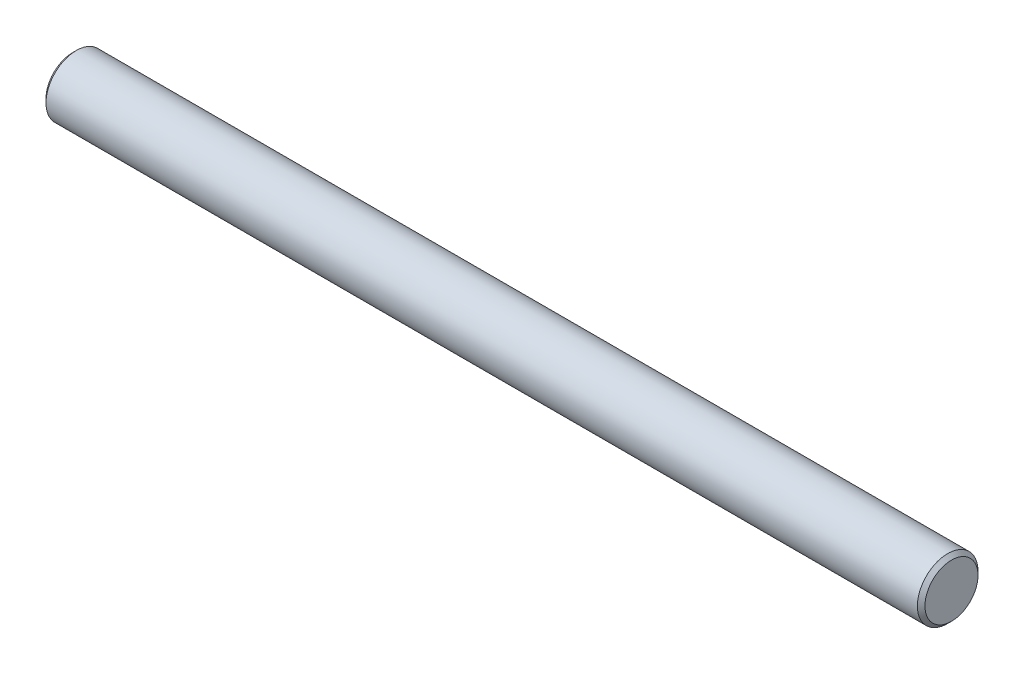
ISO-10303-21;
HEADER;
FILE_DESCRIPTION(('STEP AP214'),'2;1');
FILE_NAME('part.step','',(''),(''),'','','');
FILE_SCHEMA(('AUTOMOTIVE_DESIGN { 1 0 10303 214 1 1 1 1 }'));
ENDSEC;
DATA;
#1=APPLICATION_CONTEXT('core data for automotive mechanical design processes');
#2=APPLICATION_PROTOCOL_DEFINITION('international standard','automotive_design',2000,#1);
#3=PRODUCT_CONTEXT('',#1,'mechanical');
#4=PRODUCT('Part','Part','',(#3));
#5=PRODUCT_RELATED_PRODUCT_CATEGORY('part','',(#4));
#6=PRODUCT_DEFINITION_FORMATION('','',#4);
#7=PRODUCT_DEFINITION_CONTEXT('part definition',#1,'design');
#8=PRODUCT_DEFINITION('design','',#6,#7);
#9=PRODUCT_DEFINITION_SHAPE('','',#8);
#10=(LENGTH_UNIT() NAMED_UNIT(*) SI_UNIT(.MILLI.,.METRE.));
#11=(NAMED_UNIT(*) PLANE_ANGLE_UNIT() SI_UNIT($,.RADIAN.));
#12=(NAMED_UNIT(*) SI_UNIT($,.STERADIAN.) SOLID_ANGLE_UNIT());
#13=UNCERTAINTY_MEASURE_WITH_UNIT(LENGTH_MEASURE(1.E-05),#10,'distance_accuracy_value','');
#14=(GEOMETRIC_REPRESENTATION_CONTEXT(3) GLOBAL_UNCERTAINTY_ASSIGNED_CONTEXT((#13)) GLOBAL_UNIT_ASSIGNED_CONTEXT((#10,
#11,#12)) REPRESENTATION_CONTEXT('',''));
#15=CARTESIAN_POINT('',(0.,0.,0.));
#16=DIRECTION('',(0.,0.,1.));
#17=DIRECTION('',(1.,0.,0.));
#18=AXIS2_PLACEMENT_3D('',#15,#16,#17);
#19=CARTESIAN_POINT('',(232.,0.,0.));
#20=DIRECTION('',(-1.,0.,0.));
#21=DIRECTION('',(0.,0.,1.));
#22=AXIS2_PLACEMENT_3D('',#19,#20,#21);
#23=CYLINDRICAL_SURFACE('',#22,8.);
#24=CARTESIAN_POINT('',(231.,0.,0.));
#25=DIRECTION('',(1.,0.,0.));
#26=DIRECTION('',(0.,0.,-1.));
#27=AXIS2_PLACEMENT_3D('',#24,#25,#26);
#28=CIRCLE('',#27,8.);
#29=CARTESIAN_POINT('',(231.,0.,8.));
#30=VERTEX_POINT('',#29);
#31=EDGE_CURVE('E9178',#30,#30,#28,.F.);
#32=CARTESIAN_POINT('',(1.00000000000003,0.,0.));
#33=DIRECTION('',(1.,0.,0.));
#34=DIRECTION('',(0.,0.,-1.));
#35=AXIS2_PLACEMENT_3D('',#32,#33,#34);
#36=CIRCLE('',#35,8.);
#37=CARTESIAN_POINT('',(1.,0.,8.));
#38=VERTEX_POINT('',#37);
#39=EDGE_CURVE('E9182',#38,#38,#36,.T.);
#40=CARTESIAN_POINT('',(231.,0.,8.));
#41=CARTESIAN_POINT('',(228.604166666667,0.,8.));
#42=CARTESIAN_POINT('',(226.208333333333,0.,8.));
#43=CARTESIAN_POINT('',(221.416666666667,0.,8.));
#44=CARTESIAN_POINT('',(219.020833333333,0.,8.));
#45=CARTESIAN_POINT('',(214.229166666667,0.,8.));
#46=CARTESIAN_POINT('',(211.833333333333,0.,8.));
#47=CARTESIAN_POINT('',(207.041666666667,0.,8.));
#48=CARTESIAN_POINT('',(204.645833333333,0.,8.));
#49=CARTESIAN_POINT('',(199.854166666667,0.,8.));
#50=CARTESIAN_POINT('',(197.458333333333,0.,8.));
#51=CARTESIAN_POINT('',(192.666666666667,0.,8.));
#52=CARTESIAN_POINT('',(190.270833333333,0.,8.));
#53=CARTESIAN_POINT('',(185.479166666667,0.,8.));
#54=CARTESIAN_POINT('',(183.083333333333,0.,8.));
#55=CARTESIAN_POINT('',(178.291666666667,0.,8.));
#56=CARTESIAN_POINT('',(175.895833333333,0.,8.));
#57=CARTESIAN_POINT('',(171.104166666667,0.,8.));
#58=CARTESIAN_POINT('',(168.708333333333,0.,8.));
#59=CARTESIAN_POINT('',(163.916666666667,0.,8.));
#60=CARTESIAN_POINT('',(161.520833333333,0.,8.));
#61=CARTESIAN_POINT('',(156.729166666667,0.,8.));
#62=CARTESIAN_POINT('',(154.333333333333,0.,8.));
#63=CARTESIAN_POINT('',(149.541666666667,0.,8.));
#64=CARTESIAN_POINT('',(147.145833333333,0.,8.));
#65=CARTESIAN_POINT('',(142.354166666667,0.,8.));
#66=CARTESIAN_POINT('',(139.958333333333,0.,8.));
#67=CARTESIAN_POINT('',(135.166666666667,0.,8.));
#68=CARTESIAN_POINT('',(132.770833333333,0.,8.));
#69=CARTESIAN_POINT('',(127.979166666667,0.,8.));
#70=CARTESIAN_POINT('',(125.583333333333,0.,8.));
#71=CARTESIAN_POINT('',(120.791666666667,0.,8.));
#72=CARTESIAN_POINT('',(118.395833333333,0.,8.));
#73=CARTESIAN_POINT('',(113.604166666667,0.,8.));
#74=CARTESIAN_POINT('',(111.208333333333,0.,8.));
#75=CARTESIAN_POINT('',(106.416666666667,0.,8.));
#76=CARTESIAN_POINT('',(104.020833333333,0.,8.));
#77=CARTESIAN_POINT('',(99.2291666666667,0.,8.));
#78=CARTESIAN_POINT('',(96.8333333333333,0.,8.));
#79=CARTESIAN_POINT('',(92.0416666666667,0.,8.));
#80=CARTESIAN_POINT('',(89.6458333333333,0.,8.));
#81=CARTESIAN_POINT('',(84.8541666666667,0.,8.));
#82=CARTESIAN_POINT('',(82.4583333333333,0.,8.));
#83=CARTESIAN_POINT('',(77.6666666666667,0.,8.));
#84=CARTESIAN_POINT('',(75.2708333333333,0.,8.));
#85=CARTESIAN_POINT('',(70.4791666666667,0.,8.));
#86=CARTESIAN_POINT('',(68.0833333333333,0.,8.));
#87=CARTESIAN_POINT('',(63.2916666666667,0.,8.));
#88=CARTESIAN_POINT('',(60.8958333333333,0.,8.));
#89=CARTESIAN_POINT('',(56.1041666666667,0.,8.));
#90=CARTESIAN_POINT('',(53.7083333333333,0.,8.));
#91=CARTESIAN_POINT('',(48.9166666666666,0.,8.));
#92=CARTESIAN_POINT('',(46.5208333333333,0.,8.));
#93=CARTESIAN_POINT('',(41.7291666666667,0.,8.));
#94=CARTESIAN_POINT('',(39.3333333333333,0.,8.));
#95=CARTESIAN_POINT('',(34.5416666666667,0.,8.));
#96=CARTESIAN_POINT('',(32.1458333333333,0.,8.));
#97=CARTESIAN_POINT('',(27.3541666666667,0.,8.));
#98=CARTESIAN_POINT('',(24.9583333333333,0.,8.));
#99=CARTESIAN_POINT('',(20.1666666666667,0.,8.));
#100=CARTESIAN_POINT('',(17.7708333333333,0.,8.));
#101=CARTESIAN_POINT('',(12.9791666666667,0.,8.));
#102=CARTESIAN_POINT('',(10.5833333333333,0.,8.));
#103=CARTESIAN_POINT('',(5.79166666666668,0.,8.));
#104=CARTESIAN_POINT('',(3.39583333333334,0.,8.));
#105=CARTESIAN_POINT('',(1.,0.,8.));
#106=B_SPLINE_CURVE_WITH_KNOTS('',3,(#40,#41,#42,#43,#44,#45,#46,#47,#48,#49,#50,#51,#52,#53,
#54,#55,#56,#57,#58,#59,#60,#61,#62,#63,#64,#65,#66,#67,#68,#69,#70,#71,#72,#73,#74,#75,#76,#77,
#78,#79,#80,#81,#82,#83,#84,#85,#86,#87,#88,#89,#90,#91,#92,#93,#94,#95,#96,#97,#98,#99,#100,
#101,#102,#103,#104,#105),.UNSPECIFIED.,.F.,.F.,(4,2,2,2,2,2,2,2,2,2,2,2,2,2,2,2,2,2,2,2,2,2,2,
2,2,2,2,2,2,2,2,2,4),(0.,7.18750000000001,14.375,21.5625,28.75,35.9375,43.125,50.3125,57.5,
64.6875,71.875,79.0625,86.25,93.4375,100.625,107.8125,115.,122.1875,129.375,136.5625,143.75,
150.9375,158.125,165.3125,172.5,179.6875,186.875,194.0625,201.25,208.4375,215.625,222.8125,
230.),.UNSPECIFIED.);
#107=EDGE_CURVE('BSEAM9172',#30,#38,#106,.T.);
#108=ORIENTED_EDGE('',*,*,#31,.T.);
#109=ORIENTED_EDGE('',*,*,#39,.T.);
#110=ORIENTED_EDGE('',*,*,#107,.T.);
#111=ORIENTED_EDGE('',*,*,#107,.F.);
#112=EDGE_LOOP('',(#108,#110,#109,#111));
#113=FACE_BOUND('',#112,.T.);
#114=ADVANCED_FACE('F9172',(#113),#23,.T.);
#115=CARTESIAN_POINT('',(232.,0.,0.));
#116=DIRECTION('',(1.,0.,0.));
#117=DIRECTION('',(0.,0.,-1.));
#118=AXIS2_PLACEMENT_3D('',#115,#116,#117);
#119=PLANE('',#118);
#120=CARTESIAN_POINT('',(232.,0.,0.));
#121=DIRECTION('',(1.,0.,0.));
#122=DIRECTION('',(0.,0.,-1.));
#123=AXIS2_PLACEMENT_3D('',#120,#121,#122);
#124=CIRCLE('',#123,7.);
#125=CARTESIAN_POINT('',(232.,0.,-7.));
#126=VERTEX_POINT('',#125);
#127=EDGE_CURVE('E9186',#126,#126,#124,.T.);
#128=ORIENTED_EDGE('',*,*,#127,.T.);
#129=EDGE_LOOP('',(#128));
#130=FACE_BOUND('',#129,.T.);
#131=ADVANCED_FACE('F9192',(#130),#119,.T.);
#132=CARTESIAN_POINT('',(0.,0.,0.));
#133=DIRECTION('',(1.,0.,0.));
#134=DIRECTION('',(0.,0.,-1.));
#135=AXIS2_PLACEMENT_3D('',#132,#133,#134);
#136=PLANE('',#135);
#137=CARTESIAN_POINT('',(0.,0.,0.));
#138=DIRECTION('',(1.,0.,0.));
#139=DIRECTION('',(0.,0.,-1.));
#140=AXIS2_PLACEMENT_3D('',#137,#138,#139);
#141=CIRCLE('',#140,6.99999999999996);
#142=CARTESIAN_POINT('',(0.,0.,-6.99999999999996));
#143=VERTEX_POINT('',#142);
#144=EDGE_CURVE('E10',#143,#143,#141,.F.);
#145=ORIENTED_EDGE('',*,*,#144,.T.);
#146=EDGE_LOOP('',(#145));
#147=FACE_BOUND('',#146,.T.);
#148=ADVANCED_FACE('F9197',(#147),#136,.F.);
#149=CARTESIAN_POINT('',(232.,0.,0.));
#150=DIRECTION('',(-1.,0.,0.));
#151=DIRECTION('',(0.,0.,1.));
#152=AXIS2_PLACEMENT_3D('',#149,#150,#151);
#153=CONICAL_SURFACE('',#152,7.,0.785398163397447);
#154=ORIENTED_EDGE('',*,*,#31,.F.);
#155=EDGE_LOOP('',(#154));
#156=FACE_BOUND('',#155,.T.);
#157=ORIENTED_EDGE('',*,*,#127,.F.);
#158=EDGE_LOOP('',(#157));
#159=FACE_BOUND('',#158,.T.);
#160=ADVANCED_FACE('F9194',(#156,#159),#153,.T.);
#161=CARTESIAN_POINT('',(1.00000000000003,0.,0.));
#162=DIRECTION('',(1.,0.,0.));
#163=DIRECTION('',(0.,0.,-1.));
#164=AXIS2_PLACEMENT_3D('',#161,#162,#163);
#165=CONICAL_SURFACE('',#164,8.,0.785398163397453);
#166=ORIENTED_EDGE('',*,*,#144,.F.);
#167=EDGE_LOOP('',(#166));
#168=FACE_BOUND('',#167,.T.);
#169=ORIENTED_EDGE('',*,*,#39,.F.);
#170=EDGE_LOOP('',(#169));
#171=FACE_BOUND('',#170,.T.);
#172=ADVANCED_FACE('F9196',(#168,#171),#165,.T.);
#173=CLOSED_SHELL('',(#114,#131,#148,#160,#172));
#174=MANIFOLD_SOLID_BREP('B2',#173);
#175=ADVANCED_BREP_SHAPE_REPRESENTATION('',(#18,#174),#14);
#176=SHAPE_DEFINITION_REPRESENTATION(#9,#175);
ENDSEC;
END-ISO-10303-21;
